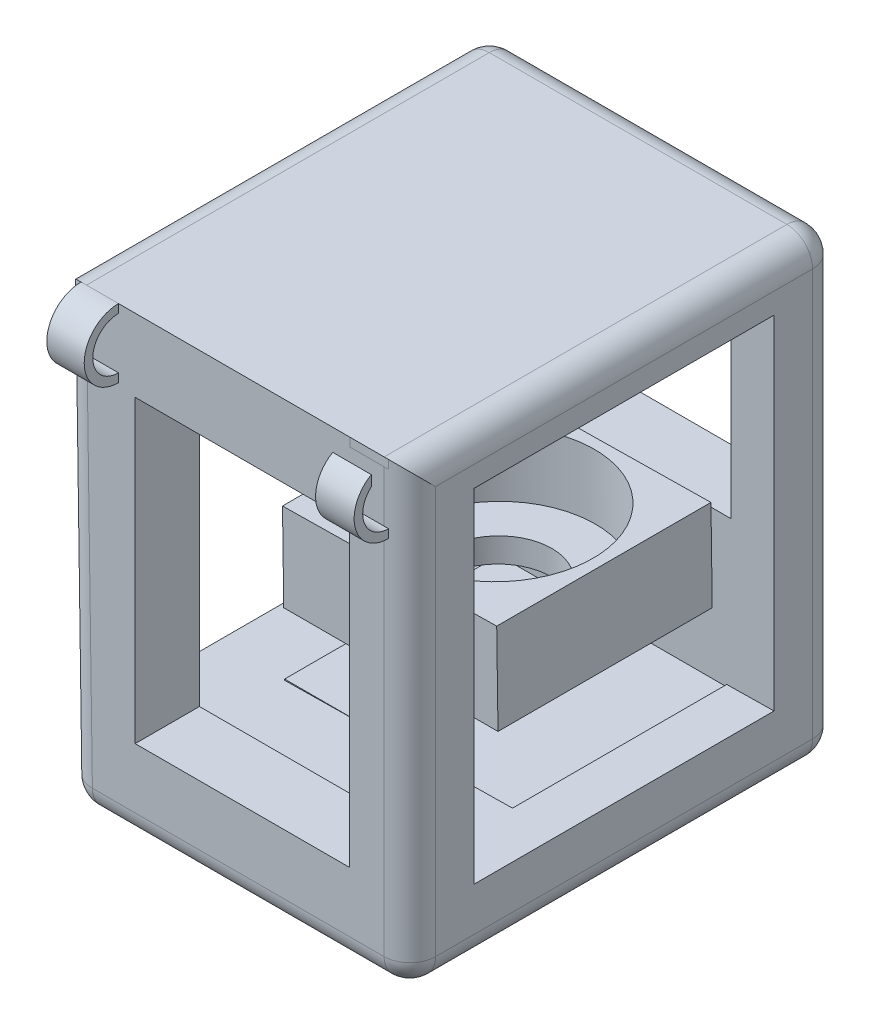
from build123d import *

# Parameters (mm, degrees)
BOSS_EXTRUDE1_DEPTH = 127
SKETCH3_W           = 88.9
SKETCH3_H           = 101.6
CUT_EXTRUDE1_DEPTH  = 127
SKETCH7_W           = 63.5
SKETCH7_H           = 38.1
CUT_EXTRUDE4_DEPTH  = 323.85
SKETCH10_W          = 63.5
SKETCH10_H          = 88.9
CUT_EXTRUDE7_DEPTH  = 24.13
SKETCH12_W          = 76.2
SKETCH12_H          = 57.15
CUT_EXTRUDE9_DEPTH  = 27.432
EXTRUDE_THIN1_DEPTH = 103.788308
CUT_EXTRUDE10_DEPTH = 177.038
SKETCH15_W          = 68.58
SKETCH15_H          = 20.32
SKETCH15_W_2        = 6.35
SKETCH15_H_2        = 20.319999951
CUT_EXTRUDE11_DEPTH = 25.4
BOSS_EXTRUDE2_START = -20.32
SKETCH17_W          = 63.5
SKETCH17_H          = 44.45
BOSS_EXTRUDE2_DEPTH = 63.5
SKETCH19_R          = 28.575
CUT_EXTRUDE12_DEPTH = 19.05
SKETCH20_R          = 15.875
CUT_EXTRUDE13_DEPTH = 11.43
SKETCH21_W          = 69.873011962
SKETCH21_H          = 18.163394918
CUT_EXTRUDE14_DEPTH = 63.5
FILLET1_R           = 7.62
SKETCH22_W          = 11.43
SKETCH22_H          = 5.08
CUT_EXTRUDE15_DEPTH = 10.922


with BuildPart() as part:
    # Sketch2 → Boss-Extrude1 (new body)
    with BuildSketch(Plane.XY):
        Polygon((0, 0), (101.6, 0), (101.6, 139.7), (35.911692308, 171.45), (-2.188307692, 152.4), align=None)
    extrude(amount=BOSS_EXTRUDE1_DEPTH)

    # Sketch3 → Cut-Extrude1 (cut)
    with BuildSketch(Plane(origin=(0, 0, 0), x_dir=(0, 0, 1), z_dir=(-0.9998969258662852, -0.014357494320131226, 0))):
        with Locations((63.5, 69.85)):
            Rectangle(SKETCH3_W, SKETCH3_H)
    extrude(amount=-CUT_EXTRUDE1_DEPTH, mode=Mode.SUBTRACT)

    # Sketch7 → Cut-Extrude4 (cut)
    with BuildSketch(Plane(origin=(101.6, 0, 0), x_dir=(0, 0, -1), z_dir=(1, 0, 0))):
        with Locations((-63.5, 158.75)):
            Rectangle(SKETCH7_W, SKETCH7_H)
    extrude(amount=-CUT_EXTRUDE4_DEPTH, mode=Mode.SUBTRACT)

    # Sketch10 → Cut-Extrude7 (cut)
    with BuildSketch(Plane.XY.offset(127)):
        with Locations((51.939740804, 69.85)):
            Rectangle(SKETCH10_W, SKETCH10_H)
    extrude(amount=-CUT_EXTRUDE7_DEPTH, mode=Mode.SUBTRACT)

    # Sketch12 → Cut-Extrude9 (cut)
    with BuildSketch(Plane(origin=(0, 0, 0), x_dir=(-1, 0, 0), z_dir=(0, 0, -1))):
        with Locations((-50.8, 92.075)):
            Rectangle(SKETCH12_W, SKETCH12_H)
    extrude(amount=-CUT_EXTRUDE9_DEPTH, mode=Mode.SUBTRACT)

    # Sketch14 → Cut-Extrude10 (cut)
    with BuildSketch(Plane.XY.offset(127)):
        Polygon((-2.188307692, 135.889999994), (-2.188307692, 152.4), (35.911692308, 171.45), (101.6, 139.7), (101.6, 135.889999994), align=None)
    extrude(amount=-CUT_EXTRUDE10_DEPTH, mode=Mode.SUBTRACT)

    # Sketch17 → Boss-Extrude2 (add)
    with BuildSketch(Plane(origin=(0, 0, 0), x_dir=(0, 0, 1), z_dir=(-0.9998969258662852, -0.014357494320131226, 0)).offset(BOSS_EXTRUDE2_START)):
        with Locations((50.8, 41.275)):
            Rectangle(SKETCH17_W, SKETCH17_H)
    extrude(amount=-BOSS_EXTRUDE2_DEPTH)

    # Sketch19 → Cut-Extrude12 (cut)
    with BuildSketch(Plane(origin=(-0.911700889, 63.493454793, 0), x_dir=(0.9998969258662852, 0.014357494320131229, 0), z_dir=(-0.014357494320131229, 0.9998969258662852, 0))):
        with Locations(Location((52.07, -50.8, 0), (0, 0, 180))):
            Circle(SKETCH19_R)
    extrude(amount=-CUT_EXTRUDE12_DEPTH, mode=Mode.SUBTRACT)

    # Sketch20 → Cut-Extrude13 (cut)
    with BuildSketch(Plane(origin=(-0.638190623, 44.445418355, 0), x_dir=(0.9998969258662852, 0.014357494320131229, 0), z_dir=(-0.014357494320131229, 0.9998969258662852, 0))):
        with Locations(Location((52.07, -50.8, 0), (0, 0, 180))):
            Circle(SKETCH20_R)
    extrude(amount=-CUT_EXTRUDE13_DEPTH, mode=Mode.SUBTRACT)

    # Sketch21 → Cut-Extrude14 (cut)
    with BuildSketch(Plane.XY.offset(82.55)):
        with Locations((52.641839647, 28.766697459)):
            Rectangle(SKETCH21_W, SKETCH21_H)
    extrude(amount=-CUT_EXTRUDE14_DEPTH, mode=Mode.SUBTRACT)

    # Fillet1
    fillet1_edges = [part.edges().sort_by_distance(p)[0] for p in [
        (-0.975620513, 67.944999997, 0),
        (49.824379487, 135.889999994, 0),
        (-0.975620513, 67.944999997, 127),
        (-1.951241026, 135.889999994, 63.5),
        (101.6, 135.889999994, 63.5),
        (101.6, 67.944999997, 127),
        (101.6, 67.944999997, 0),
        (50.8, 0, 0),
        (50.8, 0, 127),
        (101.6, 0, 63.5),
        (0, 0, 63.5),
    ]]
    fillet(fillet1_edges, radius=FILLET1_R)


with BuildPart() as body_2:
    # Sketch13 → Extrude-Thin1 (new, through all)
    with BuildSketch(Plane(origin=(101.6, 0, 0), x_dir=(0, 0, -1), z_dir=(1, 0, 0))):
        with BuildLine():
            ThreePointArc((-127, 133.35), (-134.619470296, 125.730000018), (-127, 118.110000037))
            Line((-127, 118.110000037), (-127.000176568, 115.570000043))
            ThreePointArc((-127.000176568, 115.570000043), (-137.159470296, 125.730000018), (-127.000176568, 135.889999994))
            Line((-127.000176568, 135.889999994), (-127, 133.35))
        make_face()
    extrude(amount=-EXTRUDE_THIN1_DEPTH)

    # Sketch15 → Cut-Extrude11 (cut)
    with BuildSketch(Plane.XY.offset(127)):
        with Locations((49.53, 125.729999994)):
            Rectangle(SKETCH15_W, SKETCH15_H)
        with Locations((0.986692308, 125.730000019)):
            Rectangle(SKETCH15_W_2, SKETCH15_H_2)
        with Locations((98.425, 125.729999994)):
            Rectangle(SKETCH15_W_2, SKETCH15_H)
    extrude(amount=CUT_EXTRUDE11_DEPTH, mode=Mode.SUBTRACT)


with BuildPart() as cut_extrude11_piece_1:
    # of the separate pieces the step leaves, piece 1, a body of its own (cut_extrude11_pieces)
    add(body_2.part.solids().sort_by_distance((95.25, 133.35, 127))[0])

    # Sketch22 → Cut-Extrude15 (cut)
    with BuildSketch(Plane(origin=(0, 135.889999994, 0), x_dir=(1, 0, 0), z_dir=(0, 1, 0))):
        with Locations((89.535, -129.540176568)):
            Rectangle(SKETCH22_W, SKETCH22_H)
    extrude(amount=-CUT_EXTRUDE15_DEPTH, mode=Mode.SUBTRACT)


with BuildPart() as cut_extrude11_piece_2:
    # of the separate pieces the step leaves, piece 2, a body of its own (cut_extrude11_pieces)
    add(body_2.part.solids().sort_by_distance((15.24, 133.35, 127))[0])


with BuildPart() as cut_extrude15_piece_1:
    # of the separate pieces the step leaves, piece 1, a body of its own (cut_extrude15_pieces)
    add(cut_extrude11_piece_1.part.solids().sort_by_distance((95.25, 131.408980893, 132.080176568))[0])


with BuildPart() as cut_extrude15_piece_2:
    # of the separate pieces the step leaves, piece 2, a body of its own (cut_extrude15_pieces)
    add(cut_extrude11_piece_1.part.solids().sort_by_distance((95.25, 133.35, 127))[0])


solid = Compound([part.part, cut_extrude11_piece_2.part, cut_extrude15_piece_1.part, cut_extrude15_piece_2.part])
